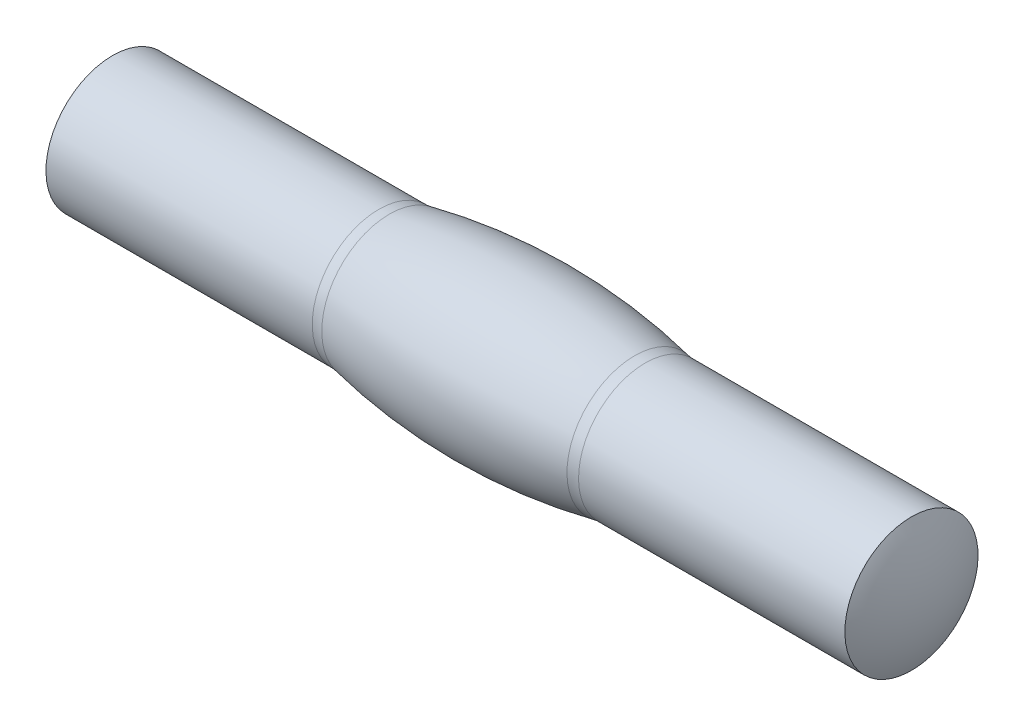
from build123d import *


with BuildPart() as part:
    # Esquisse1 → R_volution1 (revolve)
    with BuildSketch(Plane.XY):
        with BuildLine():
            Line((5, 2.5), (15, 2.5))
            ThreePointArc((15, 2.5), (15.447900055, 1.285496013), (15.6, 0))
            Line((15.6, 0), (-15.6, 0))
            ThreePointArc((-15.6, 0), (-15.447900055, 1.285496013), (-15, 2.5))
            Line((-15, 2.5), (-5, 2.5))
            ThreePointArc((-5, 2.5), (-4.800992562, 2.50992562), (-4.603960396, 2.53960396))
            ThreePointArc((-4.603960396, 2.53960396), (0, 3), (4.603960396, 2.53960396))
            ThreePointArc((4.603960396, 2.53960396), (4.800992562, 2.50992562), (5, 2.5))
        make_face()
    revolve(axis=Axis((46.615391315, 0, 0), (-1, 0, 0)))


solid = part.part
